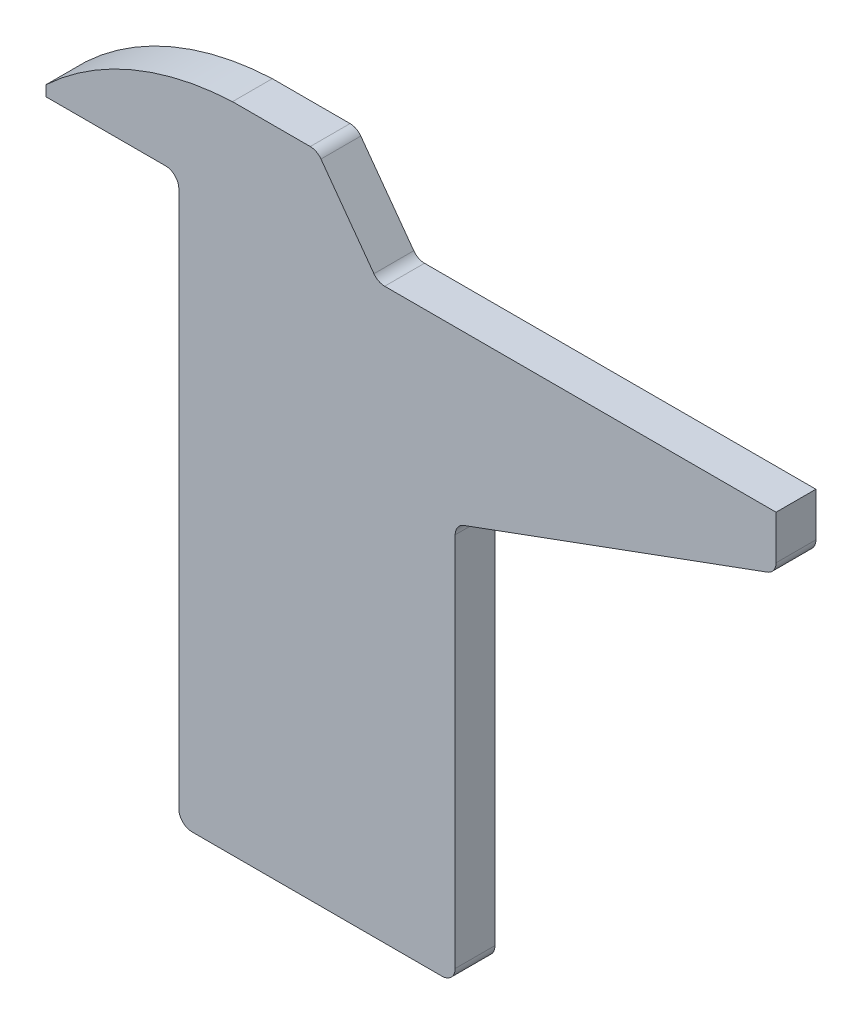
from build123d import *

# Parameters (mm, degrees)
BOSS_EXTRU_1_DEPTH = 3


with BuildPart() as part:
    # Esquisse1 → Boss.-Extru.1 (new body)
    with BuildSketch(Plane(origin=(0, 0, 0), x_dir=(-1, 0, 0), z_dir=(0, 0, -1))):
        with BuildLine():
            Line((-15.822446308, -13.363539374), (-15.822446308, -41.665103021))
            ThreePointArc((-15.822446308, -41.665103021), (-15.529553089, -42.372209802), (-14.822446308, -42.665103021))
            Line((-14.822446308, -42.665103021), (4, -42.665103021))
            ThreePointArc((4, -42.665103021), (4.707106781, -42.372209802), (5, -41.665103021))
            Line((5, -41.665103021), (5, -1.2))
            ThreePointArc((5, -1.2), (5.292893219, -0.492893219), (6, -0.2))
            Line((6, -0.2), (15, -0.2))
            Line((15, -0.2), (15, 0.6))
            ThreePointArc((15, 0.6), (8.508004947, 4.814199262), (0.956392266, 6.510849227))
            Line((0.956392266, 6.510849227), (-4.901937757, 6.510849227))
            ThreePointArc((-4.901937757, 6.510849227), (-5.355758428, 6.401942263), (-5.710730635, 6.098942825))
            Line((-5.710730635, 6.098942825), (-9.700492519, 0.611906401))
            ThreePointArc((-9.700492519, 0.611906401), (-10.055464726, 0.308906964), (-10.509285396, 0.2))
            Line((-10.509285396, 0.2), (-40, 0.2))
            Line((-40, 0.2), (-40, -3.101563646))
            ThreePointArc((-40, -3.101563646), (-39.819833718, -3.674165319), (-39.344254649, -4.040439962))
            Line((-39.344254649, -4.040439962), (-16.478191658, -12.424663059))
            ThreePointArc((-16.478191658, -12.424663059), (-16.00261259, -12.790937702), (-15.822446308, -13.363539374))
        make_face()
    extrude(amount=BOSS_EXTRU_1_DEPTH)


solid = part.part
